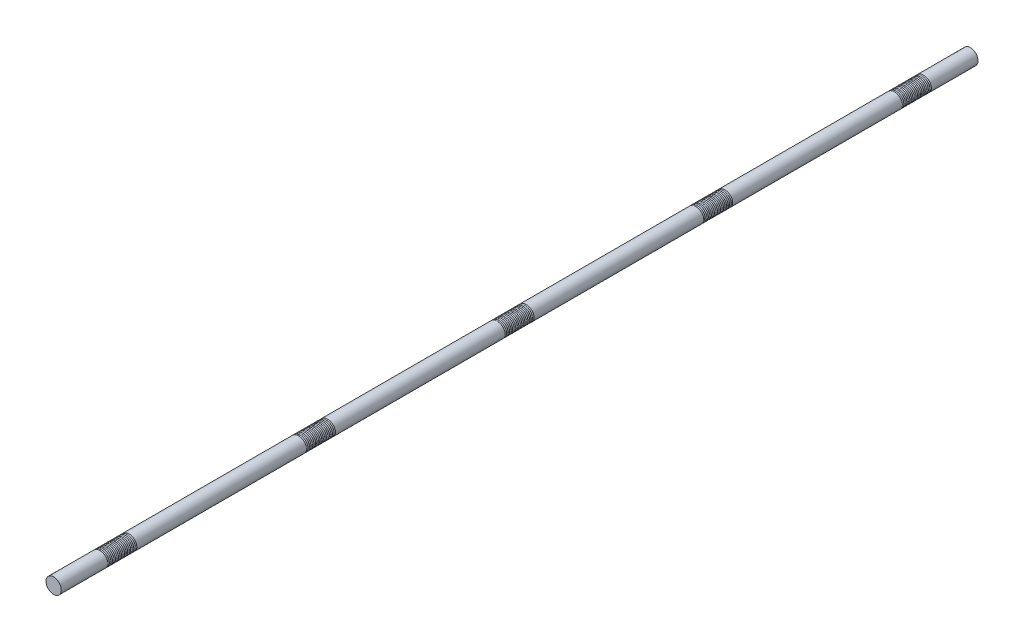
from build123d import *

# Parameters (mm, degrees)
SKETCH1_R              = 25
BOSS_EXTRUDE1_DEPTH    = 3000
CUT_SWEEP1_PITCH       = 10
CUT_SWEEP1_HEIGHT      = 100
CUT_SWEEP1_RADIUS      = 27.116666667
CUT_SWEEP1_START_ANGLE = -180
SKETCH3_R              = 3.175
LPATTERN1_COUNT        = 5
LPATTERN1_PITCH        = 650


with BuildPart() as part:
    # Sketch1 → Boss-Extrude1 (new body)
    with BuildSketch(Plane.XY):
        Circle(SKETCH1_R)
    extrude(amount=BOSS_EXTRUDE1_DEPTH)

    # Cut-Sweep1: sweep along a helix
    with BuildLine() as cut_sweep1_path:
        add(Helix(CUT_SWEEP1_PITCH, CUT_SWEEP1_HEIGHT, CUT_SWEEP1_RADIUS, center=(0, 0, 150), direction=(0, 0, 1), mode=Mode.PRIVATE).rotate(Axis((0, 0, 150), (0, 0, 1)), CUT_SWEEP1_START_ANGLE))
    # Sketch3 → Cut-Sweep1 (sweep, cut)
    with BuildSketch(Plane(origin=(0, 0, 0), x_dir=(1, 0, 0), z_dir=(0, 1, 0))):
        with Locations((-27.116666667, -150)):
            Circle(SKETCH3_R)
    cut_sweep1 = sweep(path=cut_sweep1_path.line, is_frenet=True, mode=Mode.SUBTRACT)

    # LPattern1: Cut-Sweep1 ×5
    with Locations(*[(0, 0, i * LPATTERN1_PITCH) for i in range(1, LPATTERN1_COUNT)]):
        add(cut_sweep1, mode=Mode.SUBTRACT)


solid = part.part
